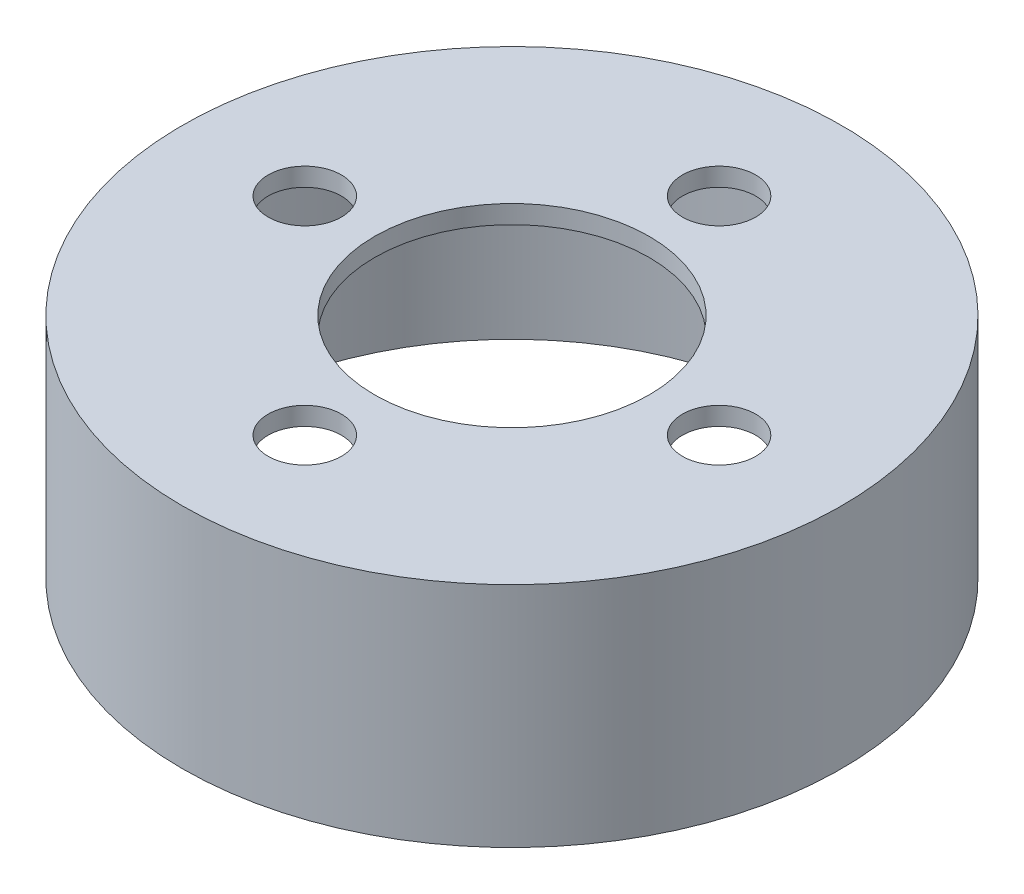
from build123d import *

# Parameters (mm, degrees)
SKETCH2_R           = 18
SKETCH2_R_2         = 16
BOSS_EXTRUDE2_DEPTH = 12.433679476
SKETCH3_R           = 16
SKETCH3_R_2         = 7.5
BOSS_EXTRUDE3_DEPTH = 1
SKETCH4_R           = 2
CUT_EXTRUDE1_DEPTH  = 1
CIRPATTERN1_COUNT   = 4


with BuildPart() as part:
    # Sketch2 → Boss-Extrude2 (new body)
    with BuildSketch(Plane(origin=(0, 0, 0), x_dir=(1, 0, 0), z_dir=(0, 1, 0))):
        with Locations(Location((0, 0, 0), (0, 0, 270))):
            Circle(SKETCH2_R)
        with Locations(Location((0, 0, 0), (0, 0, 270))):
            Circle(SKETCH2_R_2, mode=Mode.SUBTRACT)
    extrude(amount=-BOSS_EXTRUDE2_DEPTH)

    # Sketch3 → Boss-Extrude3 (add)
    with BuildSketch(Plane(origin=(0, 0, 0), x_dir=(1, 0, 0), z_dir=(0, 1, 0))):
        with Locations(Location((0, 0, 0), (0, 0, 270))):
            Circle(SKETCH3_R)
        with Locations(Location((0, 0, 0), (0, 0, 270))):
            Circle(SKETCH3_R_2, mode=Mode.SUBTRACT)
    extrude(amount=-BOSS_EXTRUDE3_DEPTH)

    # Sketch4 → Cut-Extrude1 (cut)
    with BuildSketch(Plane(origin=(0, 0, 0), x_dir=(1, 0, 0), z_dir=(0, 1, 0))):
        with Locations(Location((0, -11.3137085, 0), (0, 0, 270))):
            Circle(SKETCH4_R)
    cut_extrude1 = extrude(amount=-CUT_EXTRUDE1_DEPTH, mode=Mode.SUBTRACT)

    # CirPattern1: Cut-Extrude1 ×4 about axis
    cirpattern1_axis = Axis((0, 0, 0), (0, 1, 0))
    for i in range(1, CIRPATTERN1_COUNT):
        add(cut_extrude1.rotate(cirpattern1_axis, i * 360 / CIRPATTERN1_COUNT), mode=Mode.SUBTRACT)


solid = part.part
